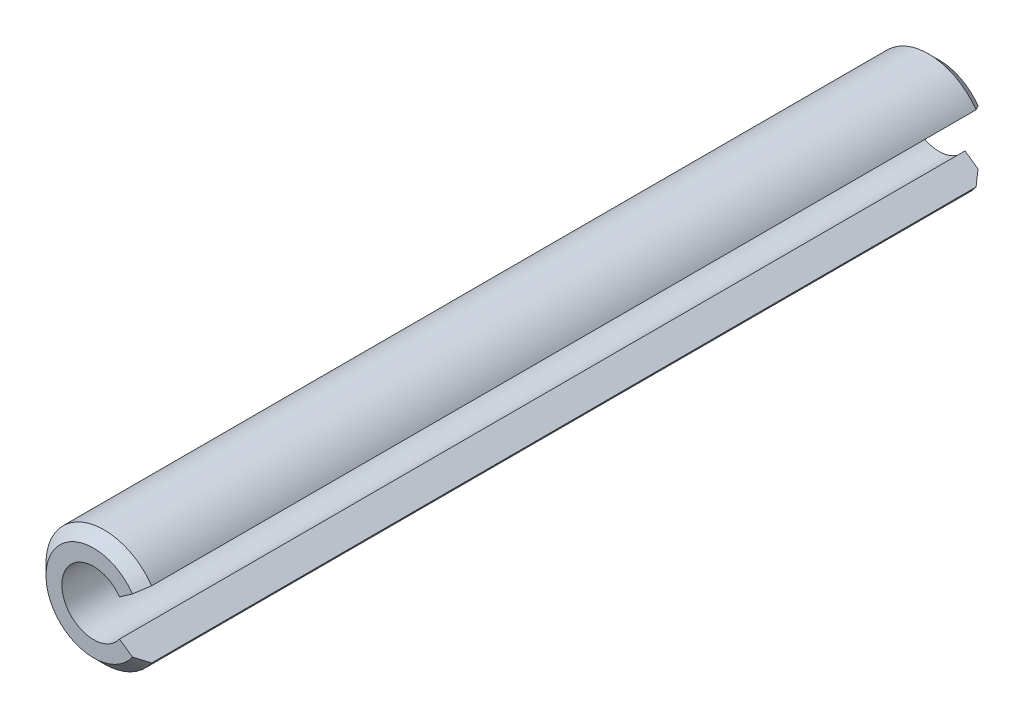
ISO-10303-21;
HEADER;
FILE_DESCRIPTION(('STEP AP214'),'2;1');
FILE_NAME('part.step','',(''),(''),'','','');
FILE_SCHEMA(('AUTOMOTIVE_DESIGN { 1 0 10303 214 1 1 1 1 }'));
ENDSEC;
DATA;
#1=APPLICATION_CONTEXT('core data for automotive mechanical design processes');
#2=APPLICATION_PROTOCOL_DEFINITION('international standard','automotive_design',2000,#1);
#3=PRODUCT_CONTEXT('',#1,'mechanical');
#4=PRODUCT('Part','Part','',(#3));
#5=PRODUCT_RELATED_PRODUCT_CATEGORY('part','',(#4));
#6=PRODUCT_DEFINITION_FORMATION('','',#4);
#7=PRODUCT_DEFINITION_CONTEXT('part definition',#1,'design');
#8=PRODUCT_DEFINITION('design','',#6,#7);
#9=PRODUCT_DEFINITION_SHAPE('','',#8);
#10=(LENGTH_UNIT() NAMED_UNIT(*) SI_UNIT(.MILLI.,.METRE.));
#11=(NAMED_UNIT(*) PLANE_ANGLE_UNIT() SI_UNIT($,.RADIAN.));
#12=(NAMED_UNIT(*) SI_UNIT($,.STERADIAN.) SOLID_ANGLE_UNIT());
#13=UNCERTAINTY_MEASURE_WITH_UNIT(LENGTH_MEASURE(1.E-05),#10,'distance_accuracy_value','');
#14=(GEOMETRIC_REPRESENTATION_CONTEXT(3) GLOBAL_UNCERTAINTY_ASSIGNED_CONTEXT((#13)) GLOBAL_UNIT_ASSIGNED_CONTEXT((#10,
#11,#12)) REPRESENTATION_CONTEXT('',''));
#15=CARTESIAN_POINT('',(0.,0.,0.));
#16=DIRECTION('',(0.,0.,1.));
#17=DIRECTION('',(1.,0.,0.));
#18=AXIS2_PLACEMENT_3D('',#15,#16,#17);
#19=CARTESIAN_POINT('',(0.,0.,16.));
#20=DIRECTION('',(0.,0.,-1.));
#21=DIRECTION('',(-1.,0.,0.));
#22=AXIS2_PLACEMENT_3D('',#19,#20,#21);
#23=CYLINDRICAL_SURFACE('',#22,0.6);
#24=CARTESIAN_POINT('',(0.,0.,0.));
#25=DIRECTION('',(0.,0.,-1.));
#26=DIRECTION('',(1.,0.,0.));
#27=AXIS2_PLACEMENT_3D('',#24,#25,#26);
#28=CIRCLE('',#27,0.6);
#29=CARTESIAN_POINT('',(0.490909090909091,-0.344975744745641,0.));
#30=VERTEX_POINT('',#29);
#31=CARTESIAN_POINT('',(0.490909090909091,0.344975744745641,0.));
#32=VERTEX_POINT('',#31);
#33=EDGE_CURVE('E89',#30,#32,#28,.T.);
#34=ORIENTED_EDGE('',*,*,#33,.T.);
#35=DIRECTION('',(0.,0.,-1.));
#36=VECTOR('',#35,1.);
#37=CARTESIAN_POINT('',(0.490909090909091,0.344975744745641,16.));
#38=LINE('',#37,#36);
#39=CARTESIAN_POINT('',(0.490909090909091,0.344975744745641,16.));
#40=VERTEX_POINT('',#39);
#41=EDGE_CURVE('E94',#40,#32,#38,.T.);
#42=ORIENTED_EDGE('',*,*,#41,.F.);
#43=CARTESIAN_POINT('',(0.,0.,16.));
#44=DIRECTION('',(0.,0.,-1.));
#45=DIRECTION('',(1.,0.,0.));
#46=AXIS2_PLACEMENT_3D('',#43,#44,#45);
#47=CIRCLE('',#46,0.6);
#48=CARTESIAN_POINT('',(0.490909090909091,-0.344975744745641,16.));
#49=VERTEX_POINT('',#48);
#50=EDGE_CURVE('E109',#49,#40,#47,.T.);
#51=ORIENTED_EDGE('',*,*,#50,.F.);
#52=DIRECTION('',(0.,0.,-1.));
#53=VECTOR('',#52,1.);
#54=CARTESIAN_POINT('',(0.490909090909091,-0.344975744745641,16.));
#55=LINE('',#54,#53);
#56=EDGE_CURVE('E105',#49,#30,#55,.T.);
#57=ORIENTED_EDGE('',*,*,#56,.T.);
#58=EDGE_LOOP('',(#34,#42,#51,#57));
#59=FACE_BOUND('',#58,.T.);
#60=ADVANCED_FACE('F33',(#59),#23,.F.);
#61=CARTESIAN_POINT('',(0.9,0.632455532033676,16.));
#62=DIRECTION('',(-0.574959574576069,0.818181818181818,0.));
#63=DIRECTION('',(-0.818181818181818,-0.574959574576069,0.));
#64=AXIS2_PLACEMENT_3D('',#61,#62,#63);
#65=PLANE('',#64);
#66=DIRECTION('',(0.818181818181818,0.574959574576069,0.));
#67=VECTOR('',#66,1.);
#68=CARTESIAN_POINT('',(0.9,0.632455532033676,0.));
#69=LINE('',#68,#67);
#70=CARTESIAN_POINT('',(0.736363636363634,0.517463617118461,0.));
#71=VERTEX_POINT('',#70);
#72=EDGE_CURVE('E85',#32,#71,#69,.T.);
#73=ORIENTED_EDGE('',*,*,#72,.T.);
#74=DIRECTION('',(-0.578541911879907,-0.406557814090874,-0.707106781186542));
#75=VECTOR('',#74,1.);
#76=CARTESIAN_POINT('',(0.,0.,-0.899999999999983));
#77=LINE('',#76,#75);
#78=CARTESIAN_POINT('',(0.9,0.632455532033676,0.199999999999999));
#79=VERTEX_POINT('',#78);
#80=EDGE_CURVE('E40',#71,#79,#77,.F.);
#81=ORIENTED_EDGE('',*,*,#80,.T.);
#82=DIRECTION('',(0.,0.,-1.));
#83=VECTOR('',#82,1.);
#84=CARTESIAN_POINT('',(0.9,0.632455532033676,16.));
#85=LINE('',#84,#83);
#86=CARTESIAN_POINT('',(0.9,0.632455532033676,15.8));
#87=VERTEX_POINT('',#86);
#88=EDGE_CURVE('E101',#87,#79,#85,.T.);
#89=ORIENTED_EDGE('',*,*,#88,.F.);
#90=DIRECTION('',(0.5785419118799,0.406557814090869,-0.707106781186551));
#91=VECTOR('',#90,1.);
#92=CARTESIAN_POINT('',(0.,0.,16.9));
#93=LINE('',#92,#91);
#94=CARTESIAN_POINT('',(0.736363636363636,0.517463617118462,16.));
#95=VERTEX_POINT('',#94);
#96=EDGE_CURVE('E47',#87,#95,#93,.F.);
#97=ORIENTED_EDGE('',*,*,#96,.T.);
#98=DIRECTION('',(0.818181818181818,0.574959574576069,0.));
#99=VECTOR('',#98,1.);
#100=CARTESIAN_POINT('',(0.9,0.632455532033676,16.));
#101=LINE('',#100,#99);
#102=EDGE_CURVE('E96',#40,#95,#101,.T.);
#103=ORIENTED_EDGE('',*,*,#102,.F.);
#104=ORIENTED_EDGE('',*,*,#41,.T.);
#105=EDGE_LOOP('',(#73,#81,#89,#97,#103,#104));
#106=FACE_BOUND('',#105,.T.);
#107=ADVANCED_FACE('F95',(#106),#65,.F.);
#108=CARTESIAN_POINT('',(0.,0.,16.));
#109=DIRECTION('',(0.,0.,-1.));
#110=DIRECTION('',(-1.,0.,0.));
#111=AXIS2_PLACEMENT_3D('',#108,#109,#110);
#112=CYLINDRICAL_SURFACE('',#111,1.1);
#113=ORIENTED_EDGE('',*,*,#88,.T.);
#114=CARTESIAN_POINT('',(0.,0.,0.199999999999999));
#115=DIRECTION('',(0.,0.,1.));
#116=DIRECTION('',(1.,0.,0.));
#117=AXIS2_PLACEMENT_3D('',#114,#115,#116);
#118=CIRCLE('',#117,1.1);
#119=CARTESIAN_POINT('',(0.9,-0.632455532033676,0.199999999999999));
#120=VERTEX_POINT('',#119);
#121=EDGE_CURVE('E121',#79,#120,#118,.T.);
#122=ORIENTED_EDGE('',*,*,#121,.T.);
#123=DIRECTION('',(0.,0.,-1.));
#124=VECTOR('',#123,1.);
#125=CARTESIAN_POINT('',(0.9,-0.632455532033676,16.));
#126=LINE('',#125,#124);
#127=CARTESIAN_POINT('',(0.9,-0.632455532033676,15.8));
#128=VERTEX_POINT('',#127);
#129=EDGE_CURVE('E115',#128,#120,#126,.T.);
#130=ORIENTED_EDGE('',*,*,#129,.F.);
#131=CARTESIAN_POINT('',(0.,0.,15.8));
#132=DIRECTION('',(0.,0.,1.));
#133=DIRECTION('',(1.,0.,0.));
#134=AXIS2_PLACEMENT_3D('',#131,#132,#133);
#135=CIRCLE('',#134,1.1);
#136=EDGE_CURVE('E100',#128,#87,#135,.F.);
#137=ORIENTED_EDGE('',*,*,#136,.T.);
#138=EDGE_LOOP('',(#113,#122,#130,#137));
#139=FACE_BOUND('',#138,.T.);
#140=ADVANCED_FACE('F132',(#139),#112,.T.);
#141=CARTESIAN_POINT('',(0.9,-0.632455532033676,16.));
#142=DIRECTION('',(-0.574959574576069,-0.818181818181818,0.));
#143=DIRECTION('',(0.818181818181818,-0.574959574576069,0.));
#144=AXIS2_PLACEMENT_3D('',#141,#142,#143);
#145=PLANE('',#144);
#146=ORIENTED_EDGE('',*,*,#129,.T.);
#147=DIRECTION('',(0.578541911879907,-0.406557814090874,0.707106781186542));
#148=VECTOR('',#147,1.);
#149=CARTESIAN_POINT('',(0.,0.,-0.899999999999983));
#150=LINE('',#149,#148);
#151=CARTESIAN_POINT('',(0.736363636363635,-0.517463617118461,0.));
#152=VERTEX_POINT('',#151);
#153=EDGE_CURVE('E126',#120,#152,#150,.F.);
#154=ORIENTED_EDGE('',*,*,#153,.T.);
#155=DIRECTION('',(-0.818181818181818,0.574959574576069,0.));
#156=VECTOR('',#155,1.);
#157=CARTESIAN_POINT('',(0.9,-0.632455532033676,0.));
#158=LINE('',#157,#156);
#159=EDGE_CURVE('E91',#152,#30,#158,.T.);
#160=ORIENTED_EDGE('',*,*,#159,.T.);
#161=ORIENTED_EDGE('',*,*,#56,.F.);
#162=DIRECTION('',(-0.818181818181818,0.574959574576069,0.));
#163=VECTOR('',#162,1.);
#164=CARTESIAN_POINT('',(0.9,-0.632455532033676,16.));
#165=LINE('',#164,#163);
#166=CARTESIAN_POINT('',(0.736363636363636,-0.517463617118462,16.));
#167=VERTEX_POINT('',#166);
#168=EDGE_CURVE('E112',#167,#49,#165,.T.);
#169=ORIENTED_EDGE('',*,*,#168,.F.);
#170=DIRECTION('',(-0.5785419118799,0.406557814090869,0.707106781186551));
#171=VECTOR('',#170,1.);
#172=CARTESIAN_POINT('',(0.,0.,16.9));
#173=LINE('',#172,#171);
#174=EDGE_CURVE('E124',#167,#128,#173,.F.);
#175=ORIENTED_EDGE('',*,*,#174,.T.);
#176=EDGE_LOOP('',(#146,#154,#160,#161,#169,#175));
#177=FACE_BOUND('',#176,.T.);
#178=ADVANCED_FACE('F137',(#177),#145,.F.);
#179=CARTESIAN_POINT('',(0.,0.,16.));
#180=DIRECTION('',(0.,0.,1.));
#181=DIRECTION('',(1.,0.,0.));
#182=AXIS2_PLACEMENT_3D('',#179,#180,#181);
#183=PLANE('',#182);
#184=ORIENTED_EDGE('',*,*,#102,.T.);
#185=CARTESIAN_POINT('',(0.,0.,16.));
#186=DIRECTION('',(0.,0.,1.));
#187=DIRECTION('',(1.,0.,0.));
#188=AXIS2_PLACEMENT_3D('',#185,#186,#187);
#189=CIRCLE('',#188,0.9);
#190=EDGE_CURVE('E11',#95,#167,#189,.T.);
#191=ORIENTED_EDGE('',*,*,#190,.T.);
#192=ORIENTED_EDGE('',*,*,#168,.T.);
#193=ORIENTED_EDGE('',*,*,#50,.T.);
#194=EDGE_LOOP('',(#184,#191,#192,#193));
#195=FACE_BOUND('',#194,.T.);
#196=ADVANCED_FACE('F143',(#195),#183,.T.);
#197=CARTESIAN_POINT('',(0.,0.,0.));
#198=DIRECTION('',(0.,0.,1.));
#199=DIRECTION('',(1.,0.,0.));
#200=AXIS2_PLACEMENT_3D('',#197,#198,#199);
#201=PLANE('',#200);
#202=ORIENTED_EDGE('',*,*,#159,.F.);
#203=CARTESIAN_POINT('',(0.,0.,0.));
#204=DIRECTION('',(0.,0.,1.));
#205=DIRECTION('',(1.,0.,0.));
#206=AXIS2_PLACEMENT_3D('',#203,#204,#205);
#207=CIRCLE('',#206,0.899999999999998);
#208=EDGE_CURVE('E55',#152,#71,#207,.F.);
#209=ORIENTED_EDGE('',*,*,#208,.T.);
#210=ORIENTED_EDGE('',*,*,#72,.F.);
#211=ORIENTED_EDGE('',*,*,#33,.F.);
#212=EDGE_LOOP('',(#202,#209,#210,#211));
#213=FACE_BOUND('',#212,.T.);
#214=ADVANCED_FACE('F87',(#213),#201,.F.);
#215=CARTESIAN_POINT('',(0.,0.,0.199999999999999));
#216=DIRECTION('',(0.,0.,1.));
#217=DIRECTION('',(1.,0.,0.));
#218=AXIS2_PLACEMENT_3D('',#215,#216,#217);
#219=CONICAL_SURFACE('',#218,1.1,0.785398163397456);
#220=ORIENTED_EDGE('',*,*,#80,.F.);
#221=ORIENTED_EDGE('',*,*,#208,.F.);
#222=ORIENTED_EDGE('',*,*,#153,.F.);
#223=ORIENTED_EDGE('',*,*,#121,.F.);
#224=EDGE_LOOP('',(#220,#221,#222,#223));
#225=FACE_BOUND('',#224,.T.);
#226=ADVANCED_FACE('F135',(#225),#219,.T.);
#227=CARTESIAN_POINT('',(0.,0.,16.));
#228=DIRECTION('',(0.,0.,-1.));
#229=DIRECTION('',(-1.,0.,0.));
#230=AXIS2_PLACEMENT_3D('',#227,#228,#229);
#231=CONICAL_SURFACE('',#230,0.9,0.785398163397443);
#232=ORIENTED_EDGE('',*,*,#96,.F.);
#233=ORIENTED_EDGE('',*,*,#136,.F.);
#234=ORIENTED_EDGE('',*,*,#174,.F.);
#235=ORIENTED_EDGE('',*,*,#190,.F.);
#236=EDGE_LOOP('',(#232,#233,#234,#235));
#237=FACE_BOUND('',#236,.T.);
#238=ADVANCED_FACE('F140',(#237),#231,.T.);
#239=CLOSED_SHELL('',(#60,#107,#140,#178,#196,#214,#226,#238));
#240=MANIFOLD_SOLID_BREP('B2',#239);
#241=ADVANCED_BREP_SHAPE_REPRESENTATION('',(#18,#240),#14);
#242=SHAPE_DEFINITION_REPRESENTATION(#9,#241);
ENDSEC;
END-ISO-10303-21;
